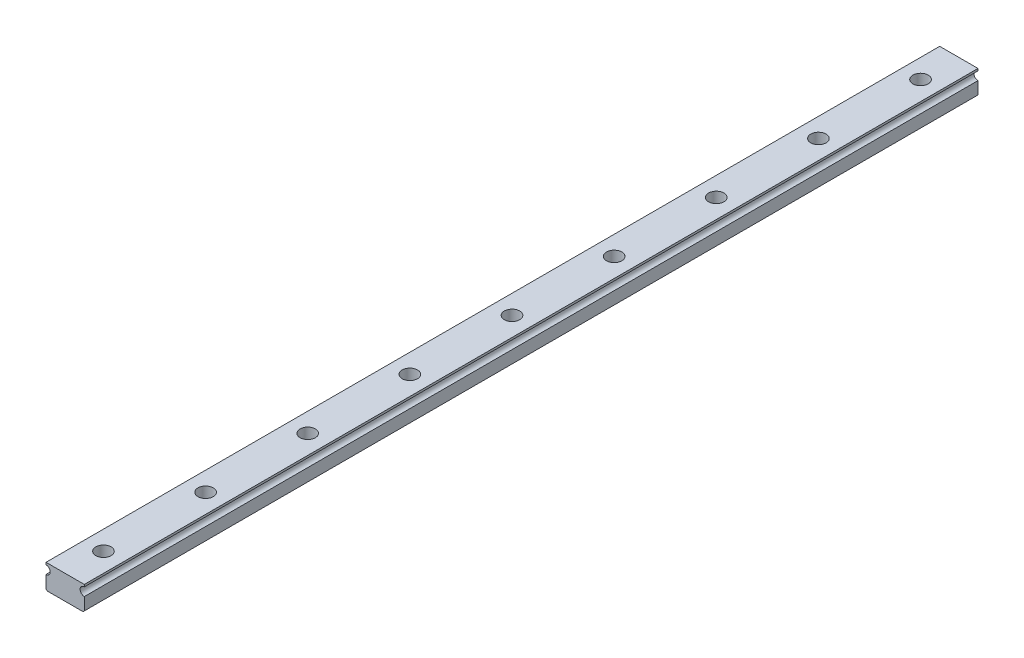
ISO-10303-21;
HEADER;
FILE_DESCRIPTION(('STEP AP214'),'2;1');
FILE_NAME('part.step','',(''),(''),'','','');
FILE_SCHEMA(('AUTOMOTIVE_DESIGN { 1 0 10303 214 1 1 1 1 }'));
ENDSEC;
DATA;
#1=APPLICATION_CONTEXT('core data for automotive mechanical design processes');
#2=APPLICATION_PROTOCOL_DEFINITION('international standard','automotive_design',2000,#1);
#3=PRODUCT_CONTEXT('',#1,'mechanical');
#4=PRODUCT('Part','Part','',(#3));
#5=PRODUCT_RELATED_PRODUCT_CATEGORY('part','',(#4));
#6=PRODUCT_DEFINITION_FORMATION('','',#4);
#7=PRODUCT_DEFINITION_CONTEXT('part definition',#1,'design');
#8=PRODUCT_DEFINITION('design','',#6,#7);
#9=PRODUCT_DEFINITION_SHAPE('','',#8);
#10=(LENGTH_UNIT() NAMED_UNIT(*) SI_UNIT(.MILLI.,.METRE.));
#11=(NAMED_UNIT(*) PLANE_ANGLE_UNIT() SI_UNIT($,.RADIAN.));
#12=(NAMED_UNIT(*) SI_UNIT($,.STERADIAN.) SOLID_ANGLE_UNIT());
#13=UNCERTAINTY_MEASURE_WITH_UNIT(LENGTH_MEASURE(1.E-05),#10,'distance_accuracy_value','');
#14=(GEOMETRIC_REPRESENTATION_CONTEXT(3) GLOBAL_UNCERTAINTY_ASSIGNED_CONTEXT((#13)) GLOBAL_UNIT_ASSIGNED_CONTEXT((#10,
#11,#12)) REPRESENTATION_CONTEXT('',''));
#15=CARTESIAN_POINT('',(0.,0.,0.));
#16=DIRECTION('',(0.,0.,1.));
#17=DIRECTION('',(1.,0.,0.));
#18=AXIS2_PLACEMENT_3D('',#15,#16,#17);
#19=CARTESIAN_POINT('',(7.5,9.5,350.));
#20=DIRECTION('',(0.,-1.,0.));
#21=DIRECTION('',(0.,0.,-1.));
#22=AXIS2_PLACEMENT_3D('',#19,#20,#21);
#23=PLANE('',#22);
#24=CARTESIAN_POINT('',(0.,9.5,95.));
#25=DIRECTION('',(0.,1.,0.));
#26=DIRECTION('',(0.,0.,1.));
#27=AXIS2_PLACEMENT_3D('',#24,#25,#26);
#28=CIRCLE('',#27,3.);
#29=CARTESIAN_POINT('',(0.,9.5,98.));
#30=VERTEX_POINT('',#29);
#31=EDGE_CURVE('E290',#30,#30,#28,.T.);
#32=ORIENTED_EDGE('',*,*,#31,.F.);
#33=EDGE_LOOP('',(#32));
#34=FACE_BOUND('',#33,.T.);
#35=CARTESIAN_POINT('',(0.,9.5,175.));
#36=DIRECTION('',(0.,1.,0.));
#37=DIRECTION('',(0.,0.,1.));
#38=AXIS2_PLACEMENT_3D('',#35,#36,#37);
#39=CIRCLE('',#38,3.);
#40=CARTESIAN_POINT('',(0.,9.5,178.));
#41=VERTEX_POINT('',#40);
#42=EDGE_CURVE('E266',#41,#41,#39,.T.);
#43=ORIENTED_EDGE('',*,*,#42,.F.);
#44=EDGE_LOOP('',(#43));
#45=FACE_BOUND('',#44,.T.);
#46=CARTESIAN_POINT('',(0.,9.5,255.));
#47=DIRECTION('',(0.,1.,0.));
#48=DIRECTION('',(0.,0.,1.));
#49=AXIS2_PLACEMENT_3D('',#46,#47,#48);
#50=CIRCLE('',#49,3.);
#51=CARTESIAN_POINT('',(0.,9.5,258.));
#52=VERTEX_POINT('',#51);
#53=EDGE_CURVE('E242',#52,#52,#50,.T.);
#54=ORIENTED_EDGE('',*,*,#53,.F.);
#55=EDGE_LOOP('',(#54));
#56=FACE_BOUND('',#55,.T.);
#57=CARTESIAN_POINT('',(0.,9.5,335.));
#58=DIRECTION('',(0.,1.,0.));
#59=DIRECTION('',(0.,0.,1.));
#60=AXIS2_PLACEMENT_3D('',#57,#58,#59);
#61=CIRCLE('',#60,3.);
#62=CARTESIAN_POINT('',(0.,9.5,338.));
#63=VERTEX_POINT('',#62);
#64=EDGE_CURVE('E218',#63,#63,#61,.T.);
#65=ORIENTED_EDGE('',*,*,#64,.F.);
#66=EDGE_LOOP('',(#65));
#67=FACE_BOUND('',#66,.T.);
#68=DIRECTION('',(-1.,0.,0.));
#69=VECTOR('',#68,1.);
#70=CARTESIAN_POINT('',(7.5,9.5,0.));
#71=LINE('',#70,#69);
#72=CARTESIAN_POINT('',(7.5,9.5,0.));
#73=VERTEX_POINT('',#72);
#74=CARTESIAN_POINT('',(-7.5,9.5,0.));
#75=VERTEX_POINT('',#74);
#76=EDGE_CURVE('E141',#73,#75,#71,.T.);
#77=ORIENTED_EDGE('',*,*,#76,.T.);
#78=DIRECTION('',(0.,0.,-1.));
#79=VECTOR('',#78,1.);
#80=CARTESIAN_POINT('',(-7.5,9.5,350.));
#81=LINE('',#80,#79);
#82=CARTESIAN_POINT('',(-7.5,9.5,350.));
#83=VERTEX_POINT('',#82);
#84=EDGE_CURVE('E11',#83,#75,#81,.T.);
#85=ORIENTED_EDGE('',*,*,#84,.F.);
#86=DIRECTION('',(-1.,0.,0.));
#87=VECTOR('',#86,1.);
#88=CARTESIAN_POINT('',(7.5,9.5,350.));
#89=LINE('',#88,#87);
#90=CARTESIAN_POINT('',(7.5,9.5,350.));
#91=VERTEX_POINT('',#90);
#92=EDGE_CURVE('E160',#91,#83,#89,.T.);
#93=ORIENTED_EDGE('',*,*,#92,.F.);
#94=DIRECTION('',(0.,0.,-1.));
#95=VECTOR('',#94,1.);
#96=CARTESIAN_POINT('',(7.5,9.5,350.));
#97=LINE('',#96,#95);
#98=EDGE_CURVE('E137',#91,#73,#97,.T.);
#99=ORIENTED_EDGE('',*,*,#98,.T.);
#100=EDGE_LOOP('',(#77,#85,#93,#99));
#101=FACE_BOUND('',#100,.T.);
#102=CARTESIAN_POINT('',(0.,9.5,15.));
#103=DIRECTION('',(0.,1.,0.));
#104=DIRECTION('',(0.,0.,1.));
#105=AXIS2_PLACEMENT_3D('',#102,#103,#104);
#106=CIRCLE('',#105,3.);
#107=CARTESIAN_POINT('',(0.,9.5,18.));
#108=VERTEX_POINT('',#107);
#109=EDGE_CURVE('E145',#108,#108,#106,.T.);
#110=ORIENTED_EDGE('',*,*,#109,.F.);
#111=EDGE_LOOP('',(#110));
#112=FACE_BOUND('',#111,.T.);
#113=CARTESIAN_POINT('',(0.,9.5,295.));
#114=DIRECTION('',(0.,1.,0.));
#115=DIRECTION('',(0.,0.,1.));
#116=AXIS2_PLACEMENT_3D('',#113,#114,#115);
#117=CIRCLE('',#116,3.);
#118=CARTESIAN_POINT('',(0.,9.5,298.));
#119=VERTEX_POINT('',#118);
#120=EDGE_CURVE('E230',#119,#119,#117,.T.);
#121=ORIENTED_EDGE('',*,*,#120,.F.);
#122=EDGE_LOOP('',(#121));
#123=FACE_BOUND('',#122,.T.);
#124=CARTESIAN_POINT('',(0.,9.5,215.));
#125=DIRECTION('',(0.,1.,0.));
#126=DIRECTION('',(0.,0.,1.));
#127=AXIS2_PLACEMENT_3D('',#124,#125,#126);
#128=CIRCLE('',#127,3.);
#129=CARTESIAN_POINT('',(0.,9.5,218.));
#130=VERTEX_POINT('',#129);
#131=EDGE_CURVE('E254',#130,#130,#128,.T.);
#132=ORIENTED_EDGE('',*,*,#131,.F.);
#133=EDGE_LOOP('',(#132));
#134=FACE_BOUND('',#133,.T.);
#135=CARTESIAN_POINT('',(0.,9.5,135.));
#136=DIRECTION('',(0.,1.,0.));
#137=DIRECTION('',(0.,0.,1.));
#138=AXIS2_PLACEMENT_3D('',#135,#136,#137);
#139=CIRCLE('',#138,3.);
#140=CARTESIAN_POINT('',(0.,9.5,138.));
#141=VERTEX_POINT('',#140);
#142=EDGE_CURVE('E278',#141,#141,#139,.T.);
#143=ORIENTED_EDGE('',*,*,#142,.F.);
#144=EDGE_LOOP('',(#143));
#145=FACE_BOUND('',#144,.T.);
#146=CARTESIAN_POINT('',(0.,9.5,55.));
#147=DIRECTION('',(0.,1.,0.));
#148=DIRECTION('',(0.,0.,1.));
#149=AXIS2_PLACEMENT_3D('',#146,#147,#148);
#150=CIRCLE('',#149,3.);
#151=CARTESIAN_POINT('',(0.,9.5,58.));
#152=VERTEX_POINT('',#151);
#153=EDGE_CURVE('E302',#152,#152,#150,.T.);
#154=ORIENTED_EDGE('',*,*,#153,.F.);
#155=EDGE_LOOP('',(#154));
#156=FACE_BOUND('',#155,.T.);
#157=ADVANCED_FACE('F33',(#34,#45,#56,#67,#101,#112,#123,#134,#145,#156),#23,.F.);
#158=CARTESIAN_POINT('',(-7.00502525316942,0.,350.));
#159=DIRECTION('',(0.,1.,0.));
#160=DIRECTION('',(0.,0.,1.));
#161=AXIS2_PLACEMENT_3D('',#158,#159,#160);
#162=PLANE('',#161);
#163=CARTESIAN_POINT('',(0.,0.,95.));
#164=DIRECTION('',(0.,1.,0.));
#165=DIRECTION('',(0.,0.,1.));
#166=AXIS2_PLACEMENT_3D('',#163,#164,#165);
#167=CIRCLE('',#166,1.75);
#168=CARTESIAN_POINT('',(0.,0.,96.75));
#169=VERTEX_POINT('',#168);
#170=EDGE_CURVE('E299',#169,#169,#167,.T.);
#171=ORIENTED_EDGE('',*,*,#170,.T.);
#172=EDGE_LOOP('',(#171));
#173=FACE_BOUND('',#172,.T.);
#174=CARTESIAN_POINT('',(0.,0.,175.));
#175=DIRECTION('',(0.,1.,0.));
#176=DIRECTION('',(0.,0.,1.));
#177=AXIS2_PLACEMENT_3D('',#174,#175,#176);
#178=CIRCLE('',#177,1.75);
#179=CARTESIAN_POINT('',(0.,0.,176.75));
#180=VERTEX_POINT('',#179);
#181=EDGE_CURVE('E275',#180,#180,#178,.T.);
#182=ORIENTED_EDGE('',*,*,#181,.T.);
#183=EDGE_LOOP('',(#182));
#184=FACE_BOUND('',#183,.T.);
#185=CARTESIAN_POINT('',(0.,0.,255.));
#186=DIRECTION('',(0.,1.,0.));
#187=DIRECTION('',(0.,0.,1.));
#188=AXIS2_PLACEMENT_3D('',#185,#186,#187);
#189=CIRCLE('',#188,1.75000000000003);
#190=CARTESIAN_POINT('',(0.,0.,256.75));
#191=VERTEX_POINT('',#190);
#192=EDGE_CURVE('E251',#191,#191,#189,.T.);
#193=ORIENTED_EDGE('',*,*,#192,.T.);
#194=EDGE_LOOP('',(#193));
#195=FACE_BOUND('',#194,.T.);
#196=CARTESIAN_POINT('',(0.,0.,335.));
#197=DIRECTION('',(0.,1.,0.));
#198=DIRECTION('',(0.,0.,1.));
#199=AXIS2_PLACEMENT_3D('',#196,#197,#198);
#200=CIRCLE('',#199,1.75000000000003);
#201=CARTESIAN_POINT('',(0.,0.,336.75));
#202=VERTEX_POINT('',#201);
#203=EDGE_CURVE('E227',#202,#202,#200,.T.);
#204=ORIENTED_EDGE('',*,*,#203,.T.);
#205=EDGE_LOOP('',(#204));
#206=FACE_BOUND('',#205,.T.);
#207=DIRECTION('',(1.,0.,0.));
#208=VECTOR('',#207,1.);
#209=CARTESIAN_POINT('',(-7.00502525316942,0.,0.));
#210=LINE('',#209,#208);
#211=CARTESIAN_POINT('',(-7.00502525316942,0.,0.));
#212=VERTEX_POINT('',#211);
#213=CARTESIAN_POINT('',(7.00502525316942,0.,0.));
#214=VERTEX_POINT('',#213);
#215=EDGE_CURVE('E153',#212,#214,#210,.T.);
#216=ORIENTED_EDGE('',*,*,#215,.T.);
#217=DIRECTION('',(0.,0.,-1.));
#218=VECTOR('',#217,1.);
#219=CARTESIAN_POINT('',(7.00502525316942,0.,350.));
#220=LINE('',#219,#218);
#221=CARTESIAN_POINT('',(7.00502525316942,0.,350.));
#222=VERTEX_POINT('',#221);
#223=EDGE_CURVE('E164',#222,#214,#220,.T.);
#224=ORIENTED_EDGE('',*,*,#223,.F.);
#225=DIRECTION('',(1.,0.,0.));
#226=VECTOR('',#225,1.);
#227=CARTESIAN_POINT('',(-7.00502525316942,0.,350.));
#228=LINE('',#227,#226);
#229=CARTESIAN_POINT('',(-7.00502525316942,0.,350.));
#230=VERTEX_POINT('',#229);
#231=EDGE_CURVE('E198',#230,#222,#228,.T.);
#232=ORIENTED_EDGE('',*,*,#231,.F.);
#233=DIRECTION('',(0.,0.,-1.));
#234=VECTOR('',#233,1.);
#235=CARTESIAN_POINT('',(-7.00502525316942,0.,350.));
#236=LINE('',#235,#234);
#237=EDGE_CURVE('E167',#230,#212,#236,.T.);
#238=ORIENTED_EDGE('',*,*,#237,.T.);
#239=EDGE_LOOP('',(#216,#224,#232,#238));
#240=FACE_BOUND('',#239,.T.);
#241=CARTESIAN_POINT('',(0.,0.,15.));
#242=DIRECTION('',(0.,1.,0.));
#243=DIRECTION('',(0.,0.,1.));
#244=AXIS2_PLACEMENT_3D('',#241,#242,#243);
#245=CIRCLE('',#244,1.75);
#246=CARTESIAN_POINT('',(0.,0.,16.75));
#247=VERTEX_POINT('',#246);
#248=EDGE_CURVE('E215',#247,#247,#245,.T.);
#249=ORIENTED_EDGE('',*,*,#248,.T.);
#250=EDGE_LOOP('',(#249));
#251=FACE_BOUND('',#250,.T.);
#252=CARTESIAN_POINT('',(0.,0.,295.));
#253=DIRECTION('',(0.,1.,0.));
#254=DIRECTION('',(0.,0.,1.));
#255=AXIS2_PLACEMENT_3D('',#252,#253,#254);
#256=CIRCLE('',#255,1.75000000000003);
#257=CARTESIAN_POINT('',(0.,0.,296.75));
#258=VERTEX_POINT('',#257);
#259=EDGE_CURVE('E239',#258,#258,#256,.T.);
#260=ORIENTED_EDGE('',*,*,#259,.T.);
#261=EDGE_LOOP('',(#260));
#262=FACE_BOUND('',#261,.T.);
#263=CARTESIAN_POINT('',(0.,0.,215.));
#264=DIRECTION('',(0.,1.,0.));
#265=DIRECTION('',(0.,0.,1.));
#266=AXIS2_PLACEMENT_3D('',#263,#264,#265);
#267=CIRCLE('',#266,1.75);
#268=CARTESIAN_POINT('',(0.,0.,216.75));
#269=VERTEX_POINT('',#268);
#270=EDGE_CURVE('E263',#269,#269,#267,.T.);
#271=ORIENTED_EDGE('',*,*,#270,.T.);
#272=EDGE_LOOP('',(#271));
#273=FACE_BOUND('',#272,.T.);
#274=CARTESIAN_POINT('',(0.,0.,135.));
#275=DIRECTION('',(0.,1.,0.));
#276=DIRECTION('',(0.,0.,1.));
#277=AXIS2_PLACEMENT_3D('',#274,#275,#276);
#278=CIRCLE('',#277,1.75);
#279=CARTESIAN_POINT('',(0.,0.,136.75));
#280=VERTEX_POINT('',#279);
#281=EDGE_CURVE('E287',#280,#280,#278,.T.);
#282=ORIENTED_EDGE('',*,*,#281,.T.);
#283=EDGE_LOOP('',(#282));
#284=FACE_BOUND('',#283,.T.);
#285=CARTESIAN_POINT('',(0.,0.,55.));
#286=DIRECTION('',(0.,1.,0.));
#287=DIRECTION('',(0.,0.,1.));
#288=AXIS2_PLACEMENT_3D('',#285,#286,#287);
#289=CIRCLE('',#288,1.75);
#290=CARTESIAN_POINT('',(0.,0.,56.75));
#291=VERTEX_POINT('',#290);
#292=EDGE_CURVE('E311',#291,#291,#289,.T.);
#293=ORIENTED_EDGE('',*,*,#292,.T.);
#294=EDGE_LOOP('',(#293));
#295=FACE_BOUND('',#294,.T.);
#296=ADVANCED_FACE('F315',(#173,#184,#195,#206,#240,#251,#262,#273,#284,#295),#162,.F.);
#297=CARTESIAN_POINT('',(-7.5,9.5,350.));
#298=DIRECTION('',(1.,0.,0.));
#299=DIRECTION('',(0.,0.,-1.));
#300=AXIS2_PLACEMENT_3D('',#297,#298,#299);
#301=PLANE('',#300);
#302=DIRECTION('',(0.,-1.,0.));
#303=VECTOR('',#302,1.);
#304=CARTESIAN_POINT('',(-7.5,9.5,0.));
#305=LINE('',#304,#303);
#306=CARTESIAN_POINT('',(-7.5,8.66,0.));
#307=VERTEX_POINT('',#306);
#308=EDGE_CURVE('E144',#75,#307,#305,.T.);
#309=ORIENTED_EDGE('',*,*,#308,.T.);
#310=DIRECTION('',(0.,0.,-1.));
#311=VECTOR('',#310,1.);
#312=CARTESIAN_POINT('',(-7.5,8.66,350.));
#313=LINE('',#312,#311);
#314=CARTESIAN_POINT('',(-7.5,8.66,350.));
#315=VERTEX_POINT('',#314);
#316=EDGE_CURVE('E41',#315,#307,#313,.T.);
#317=ORIENTED_EDGE('',*,*,#316,.F.);
#318=DIRECTION('',(0.,-1.,0.));
#319=VECTOR('',#318,1.);
#320=CARTESIAN_POINT('',(-7.5,9.5,350.));
#321=LINE('',#320,#319);
#322=EDGE_CURVE('E98',#83,#315,#321,.T.);
#323=ORIENTED_EDGE('',*,*,#322,.F.);
#324=ORIENTED_EDGE('',*,*,#84,.T.);
#325=EDGE_LOOP('',(#309,#317,#323,#324));
#326=FACE_BOUND('',#325,.T.);
#327=ADVANCED_FACE('F333',(#326),#301,.F.);
#328=CARTESIAN_POINT('',(-7.5,7.02,350.));
#329=DIRECTION('',(0.,0.,-1.));
#330=DIRECTION('',(-1.,0.,0.));
#331=AXIS2_PLACEMENT_3D('',#328,#329,#330);
#332=CYLINDRICAL_SURFACE('',#331,1.64);
#333=CARTESIAN_POINT('',(-7.5,7.02,0.));
#334=DIRECTION('',(0.,0.,-1.));
#335=DIRECTION('',(-1.,0.,0.));
#336=AXIS2_PLACEMENT_3D('',#333,#334,#335);
#337=CIRCLE('',#336,1.64);
#338=CARTESIAN_POINT('',(-7.5,5.38,0.));
#339=VERTEX_POINT('',#338);
#340=EDGE_CURVE('E147',#307,#339,#337,.T.);
#341=ORIENTED_EDGE('',*,*,#340,.T.);
#342=DIRECTION('',(0.,0.,-1.));
#343=VECTOR('',#342,1.);
#344=CARTESIAN_POINT('',(-7.5,5.38,350.));
#345=LINE('',#344,#343);
#346=CARTESIAN_POINT('',(-7.5,5.38,350.));
#347=VERTEX_POINT('',#346);
#348=EDGE_CURVE('E173',#347,#339,#345,.T.);
#349=ORIENTED_EDGE('',*,*,#348,.F.);
#350=CARTESIAN_POINT('',(-7.5,7.02,350.));
#351=DIRECTION('',(0.,0.,-1.));
#352=DIRECTION('',(-1.,0.,0.));
#353=AXIS2_PLACEMENT_3D('',#350,#351,#352);
#354=CIRCLE('',#353,1.64);
#355=EDGE_CURVE('E181',#315,#347,#354,.T.);
#356=ORIENTED_EDGE('',*,*,#355,.F.);
#357=ORIENTED_EDGE('',*,*,#316,.T.);
#358=EDGE_LOOP('',(#341,#349,#356,#357));
#359=FACE_BOUND('',#358,.T.);
#360=ADVANCED_FACE('F179',(#359),#332,.F.);
#361=CARTESIAN_POINT('',(-7.5,5.38,350.));
#362=DIRECTION('',(1.,0.,0.));
#363=DIRECTION('',(0.,0.,-1.));
#364=AXIS2_PLACEMENT_3D('',#361,#362,#363);
#365=PLANE('',#364);
#366=DIRECTION('',(0.,-1.,0.));
#367=VECTOR('',#366,1.);
#368=CARTESIAN_POINT('',(-7.5,5.38,0.));
#369=LINE('',#368,#367);
#370=CARTESIAN_POINT('',(-7.5,0.494974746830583,0.));
#371=VERTEX_POINT('',#370);
#372=EDGE_CURVE('E149',#339,#371,#369,.T.);
#373=ORIENTED_EDGE('',*,*,#372,.T.);
#374=DIRECTION('',(0.,0.,-1.));
#375=VECTOR('',#374,1.);
#376=CARTESIAN_POINT('',(-7.5,0.494974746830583,350.));
#377=LINE('',#376,#375);
#378=CARTESIAN_POINT('',(-7.5,0.494974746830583,350.));
#379=VERTEX_POINT('',#378);
#380=EDGE_CURVE('E170',#379,#371,#377,.T.);
#381=ORIENTED_EDGE('',*,*,#380,.F.);
#382=DIRECTION('',(0.,-1.,0.));
#383=VECTOR('',#382,1.);
#384=CARTESIAN_POINT('',(-7.5,5.38,350.));
#385=LINE('',#384,#383);
#386=EDGE_CURVE('E199',#347,#379,#385,.T.);
#387=ORIENTED_EDGE('',*,*,#386,.F.);
#388=ORIENTED_EDGE('',*,*,#348,.T.);
#389=EDGE_LOOP('',(#373,#381,#387,#388));
#390=FACE_BOUND('',#389,.T.);
#391=ADVANCED_FACE('F190',(#390),#365,.F.);
#392=CARTESIAN_POINT('',(-7.5,0.494974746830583,350.));
#393=DIRECTION('',(0.707106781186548,0.707106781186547,0.));
#394=DIRECTION('',(-0.707106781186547,0.707106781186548,0.));
#395=AXIS2_PLACEMENT_3D('',#392,#393,#394);
#396=PLANE('',#395);
#397=DIRECTION('',(0.707106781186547,-0.707106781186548,0.));
#398=VECTOR('',#397,1.);
#399=CARTESIAN_POINT('',(-7.5,0.494974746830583,0.));
#400=LINE('',#399,#398);
#401=EDGE_CURVE('E151',#371,#212,#400,.T.);
#402=ORIENTED_EDGE('',*,*,#401,.T.);
#403=ORIENTED_EDGE('',*,*,#237,.F.);
#404=DIRECTION('',(0.707106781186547,-0.707106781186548,0.));
#405=VECTOR('',#404,1.);
#406=CARTESIAN_POINT('',(-7.5,0.494974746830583,350.));
#407=LINE('',#406,#405);
#408=EDGE_CURVE('E196',#379,#230,#407,.T.);
#409=ORIENTED_EDGE('',*,*,#408,.F.);
#410=ORIENTED_EDGE('',*,*,#380,.T.);
#411=EDGE_LOOP('',(#402,#403,#409,#410));
#412=FACE_BOUND('',#411,.T.);
#413=ADVANCED_FACE('F194',(#412),#396,.F.);
#414=CARTESIAN_POINT('',(7.00502525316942,0.,350.));
#415=DIRECTION('',(-0.707106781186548,0.707106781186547,0.));
#416=DIRECTION('',(-0.707106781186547,-0.707106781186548,0.));
#417=AXIS2_PLACEMENT_3D('',#414,#415,#416);
#418=PLANE('',#417);
#419=DIRECTION('',(0.707106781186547,0.707106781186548,0.));
#420=VECTOR('',#419,1.);
#421=CARTESIAN_POINT('',(7.00502525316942,0.,0.));
#422=LINE('',#421,#420);
#423=CARTESIAN_POINT('',(7.5,0.494974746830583,0.));
#424=VERTEX_POINT('',#423);
#425=EDGE_CURVE('E155',#214,#424,#422,.T.);
#426=ORIENTED_EDGE('',*,*,#425,.T.);
#427=DIRECTION('',(0.,0.,-1.));
#428=VECTOR('',#427,1.);
#429=CARTESIAN_POINT('',(7.5,0.494974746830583,350.));
#430=LINE('',#429,#428);
#431=CARTESIAN_POINT('',(7.5,0.494974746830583,350.));
#432=VERTEX_POINT('',#431);
#433=EDGE_CURVE('E132',#432,#424,#430,.T.);
#434=ORIENTED_EDGE('',*,*,#433,.F.);
#435=DIRECTION('',(0.707106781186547,0.707106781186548,0.));
#436=VECTOR('',#435,1.);
#437=CARTESIAN_POINT('',(7.00502525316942,0.,350.));
#438=LINE('',#437,#436);
#439=EDGE_CURVE('E123',#222,#432,#438,.T.);
#440=ORIENTED_EDGE('',*,*,#439,.F.);
#441=ORIENTED_EDGE('',*,*,#223,.T.);
#442=EDGE_LOOP('',(#426,#434,#440,#441));
#443=FACE_BOUND('',#442,.T.);
#444=ADVANCED_FACE('F472',(#443),#418,.F.);
#445=CARTESIAN_POINT('',(7.5,0.494974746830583,350.));
#446=DIRECTION('',(-1.,0.,0.));
#447=DIRECTION('',(0.,0.,1.));
#448=AXIS2_PLACEMENT_3D('',#445,#446,#447);
#449=PLANE('',#448);
#450=DIRECTION('',(0.,1.,0.));
#451=VECTOR('',#450,1.);
#452=CARTESIAN_POINT('',(7.5,0.494974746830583,0.));
#453=LINE('',#452,#451);
#454=CARTESIAN_POINT('',(7.5,5.38,0.));
#455=VERTEX_POINT('',#454);
#456=EDGE_CURVE('E131',#424,#455,#453,.T.);
#457=ORIENTED_EDGE('',*,*,#456,.T.);
#458=DIRECTION('',(0.,0.,-1.));
#459=VECTOR('',#458,1.);
#460=CARTESIAN_POINT('',(7.5,5.38,350.));
#461=LINE('',#460,#459);
#462=CARTESIAN_POINT('',(7.5,5.38,350.));
#463=VERTEX_POINT('',#462);
#464=EDGE_CURVE('E128',#463,#455,#461,.T.);
#465=ORIENTED_EDGE('',*,*,#464,.F.);
#466=DIRECTION('',(0.,1.,0.));
#467=VECTOR('',#466,1.);
#468=CARTESIAN_POINT('',(7.5,0.494974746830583,350.));
#469=LINE('',#468,#467);
#470=EDGE_CURVE('E117',#432,#463,#469,.T.);
#471=ORIENTED_EDGE('',*,*,#470,.F.);
#472=ORIENTED_EDGE('',*,*,#433,.T.);
#473=EDGE_LOOP('',(#457,#465,#471,#472));
#474=FACE_BOUND('',#473,.T.);
#475=ADVANCED_FACE('F129',(#474),#449,.F.);
#476=CARTESIAN_POINT('',(7.5,7.02,350.));
#477=DIRECTION('',(0.,0.,-1.));
#478=DIRECTION('',(-1.,0.,0.));
#479=AXIS2_PLACEMENT_3D('',#476,#477,#478);
#480=CYLINDRICAL_SURFACE('',#479,1.64);
#481=CARTESIAN_POINT('',(7.5,7.02,0.));
#482=DIRECTION('',(0.,0.,-1.));
#483=DIRECTION('',(-1.,0.,0.));
#484=AXIS2_PLACEMENT_3D('',#481,#482,#483);
#485=CIRCLE('',#484,1.64);
#486=CARTESIAN_POINT('',(7.5,8.66,0.));
#487=VERTEX_POINT('',#486);
#488=EDGE_CURVE('E84',#455,#487,#485,.T.);
#489=ORIENTED_EDGE('',*,*,#488,.T.);
#490=DIRECTION('',(0.,0.,-1.));
#491=VECTOR('',#490,1.);
#492=CARTESIAN_POINT('',(7.5,8.66,350.));
#493=LINE('',#492,#491);
#494=CARTESIAN_POINT('',(7.5,8.66,350.));
#495=VERTEX_POINT('',#494);
#496=EDGE_CURVE('E133',#495,#487,#493,.T.);
#497=ORIENTED_EDGE('',*,*,#496,.F.);
#498=CARTESIAN_POINT('',(7.5,7.02,350.));
#499=DIRECTION('',(0.,0.,-1.));
#500=DIRECTION('',(-1.,0.,0.));
#501=AXIS2_PLACEMENT_3D('',#498,#499,#500);
#502=CIRCLE('',#501,1.64);
#503=EDGE_CURVE('E121',#463,#495,#502,.T.);
#504=ORIENTED_EDGE('',*,*,#503,.F.);
#505=ORIENTED_EDGE('',*,*,#464,.T.);
#506=EDGE_LOOP('',(#489,#497,#504,#505));
#507=FACE_BOUND('',#506,.T.);
#508=ADVANCED_FACE('F135',(#507),#480,.F.);
#509=CARTESIAN_POINT('',(7.5,8.66,350.));
#510=DIRECTION('',(-1.,0.,0.));
#511=DIRECTION('',(0.,0.,1.));
#512=AXIS2_PLACEMENT_3D('',#509,#510,#511);
#513=PLANE('',#512);
#514=DIRECTION('',(0.,1.,0.));
#515=VECTOR('',#514,1.);
#516=CARTESIAN_POINT('',(7.5,8.66,0.));
#517=LINE('',#516,#515);
#518=EDGE_CURVE('E90',#487,#73,#517,.T.);
#519=ORIENTED_EDGE('',*,*,#518,.T.);
#520=ORIENTED_EDGE('',*,*,#98,.F.);
#521=DIRECTION('',(0.,1.,0.));
#522=VECTOR('',#521,1.);
#523=CARTESIAN_POINT('',(7.5,8.66,350.));
#524=LINE('',#523,#522);
#525=EDGE_CURVE('E49',#495,#91,#524,.T.);
#526=ORIENTED_EDGE('',*,*,#525,.F.);
#527=ORIENTED_EDGE('',*,*,#496,.T.);
#528=EDGE_LOOP('',(#519,#520,#526,#527));
#529=FACE_BOUND('',#528,.T.);
#530=ADVANCED_FACE('F463',(#529),#513,.F.);
#531=CARTESIAN_POINT('',(-7.5,7.02,350.));
#532=DIRECTION('',(0.,0.,-1.));
#533=DIRECTION('',(-1.,0.,0.));
#534=AXIS2_PLACEMENT_3D('',#531,#532,#533);
#535=PLANE('',#534);
#536=ORIENTED_EDGE('',*,*,#92,.T.);
#537=ORIENTED_EDGE('',*,*,#322,.T.);
#538=ORIENTED_EDGE('',*,*,#355,.T.);
#539=ORIENTED_EDGE('',*,*,#386,.T.);
#540=ORIENTED_EDGE('',*,*,#408,.T.);
#541=ORIENTED_EDGE('',*,*,#231,.T.);
#542=ORIENTED_EDGE('',*,*,#439,.T.);
#543=ORIENTED_EDGE('',*,*,#470,.T.);
#544=ORIENTED_EDGE('',*,*,#503,.T.);
#545=ORIENTED_EDGE('',*,*,#525,.T.);
#546=EDGE_LOOP('',(#536,#537,#538,#539,#540,#541,#542,#543,#544,#545));
#547=FACE_BOUND('',#546,.T.);
#548=ADVANCED_FACE('F119',(#547),#535,.F.);
#549=CARTESIAN_POINT('',(-7.5,7.02,0.));
#550=DIRECTION('',(0.,0.,-1.));
#551=DIRECTION('',(-1.,0.,0.));
#552=AXIS2_PLACEMENT_3D('',#549,#550,#551);
#553=PLANE('',#552);
#554=ORIENTED_EDGE('',*,*,#76,.F.);
#555=ORIENTED_EDGE('',*,*,#518,.F.);
#556=ORIENTED_EDGE('',*,*,#488,.F.);
#557=ORIENTED_EDGE('',*,*,#456,.F.);
#558=ORIENTED_EDGE('',*,*,#425,.F.);
#559=ORIENTED_EDGE('',*,*,#215,.F.);
#560=ORIENTED_EDGE('',*,*,#401,.F.);
#561=ORIENTED_EDGE('',*,*,#372,.F.);
#562=ORIENTED_EDGE('',*,*,#340,.F.);
#563=ORIENTED_EDGE('',*,*,#308,.F.);
#564=EDGE_LOOP('',(#554,#555,#556,#557,#558,#559,#560,#561,#562,#563));
#565=FACE_BOUND('',#564,.T.);
#566=ADVANCED_FACE('F185',(#565),#553,.T.);
#567=CARTESIAN_POINT('',(0.,0.,15.));
#568=DIRECTION('',(0.,1.,0.));
#569=DIRECTION('',(0.,0.,1.));
#570=AXIS2_PLACEMENT_3D('',#567,#568,#569);
#571=CYLINDRICAL_SURFACE('',#570,3.);
#572=ORIENTED_EDGE('',*,*,#109,.T.);
#573=EDGE_LOOP('',(#572));
#574=FACE_BOUND('',#573,.T.);
#575=CARTESIAN_POINT('',(0.,5.,15.));
#576=DIRECTION('',(0.,1.,0.));
#577=DIRECTION('',(0.,0.,1.));
#578=AXIS2_PLACEMENT_3D('',#575,#576,#577);
#579=CIRCLE('',#578,3.);
#580=CARTESIAN_POINT('',(0.,5.,18.));
#581=VERTEX_POINT('',#580);
#582=EDGE_CURVE('E209',#581,#581,#579,.T.);
#583=ORIENTED_EDGE('',*,*,#582,.F.);
#584=EDGE_LOOP('',(#583));
#585=FACE_BOUND('',#584,.T.);
#586=ADVANCED_FACE('F456',(#574,#585),#571,.F.);
#587=CARTESIAN_POINT('',(0.,5.,12.));
#588=DIRECTION('',(0.,1.,0.));
#589=DIRECTION('',(0.,0.,1.));
#590=AXIS2_PLACEMENT_3D('',#587,#588,#589);
#591=PLANE('',#590);
#592=ORIENTED_EDGE('',*,*,#582,.T.);
#593=EDGE_LOOP('',(#592));
#594=FACE_BOUND('',#593,.T.);
#595=CARTESIAN_POINT('',(0.,5.,15.));
#596=DIRECTION('',(0.,1.,0.));
#597=DIRECTION('',(0.,0.,1.));
#598=AXIS2_PLACEMENT_3D('',#595,#596,#597);
#599=CIRCLE('',#598,1.75);
#600=CARTESIAN_POINT('',(0.,5.,16.75));
#601=VERTEX_POINT('',#600);
#602=EDGE_CURVE('E212',#601,#601,#599,.T.);
#603=ORIENTED_EDGE('',*,*,#602,.F.);
#604=EDGE_LOOP('',(#603));
#605=FACE_BOUND('',#604,.T.);
#606=ADVANCED_FACE('F452',(#594,#605),#591,.T.);
#607=CARTESIAN_POINT('',(0.,0.,15.));
#608=DIRECTION('',(0.,1.,0.));
#609=DIRECTION('',(0.,0.,1.));
#610=AXIS2_PLACEMENT_3D('',#607,#608,#609);
#611=CYLINDRICAL_SURFACE('',#610,1.75);
#612=ORIENTED_EDGE('',*,*,#602,.T.);
#613=EDGE_LOOP('',(#612));
#614=FACE_BOUND('',#613,.T.);
#615=ORIENTED_EDGE('',*,*,#248,.F.);
#616=EDGE_LOOP('',(#615));
#617=FACE_BOUND('',#616,.T.);
#618=ADVANCED_FACE('F448',(#614,#617),#611,.F.);
#619=CARTESIAN_POINT('',(0.,0.,335.));
#620=DIRECTION('',(0.,1.,0.));
#621=DIRECTION('',(0.,0.,1.));
#622=AXIS2_PLACEMENT_3D('',#619,#620,#621);
#623=CYLINDRICAL_SURFACE('',#622,3.);
#624=ORIENTED_EDGE('',*,*,#64,.T.);
#625=EDGE_LOOP('',(#624));
#626=FACE_BOUND('',#625,.T.);
#627=CARTESIAN_POINT('',(0.,5.,335.));
#628=DIRECTION('',(0.,1.,0.));
#629=DIRECTION('',(0.,0.,1.));
#630=AXIS2_PLACEMENT_3D('',#627,#628,#629);
#631=CIRCLE('',#630,3.);
#632=CARTESIAN_POINT('',(0.,5.,338.));
#633=VERTEX_POINT('',#632);
#634=EDGE_CURVE('E221',#633,#633,#631,.T.);
#635=ORIENTED_EDGE('',*,*,#634,.F.);
#636=EDGE_LOOP('',(#635));
#637=FACE_BOUND('',#636,.T.);
#638=ADVANCED_FACE('F444',(#626,#637),#623,.F.);
#639=CARTESIAN_POINT('',(0.,5.,332.));
#640=DIRECTION('',(0.,1.,0.));
#641=DIRECTION('',(0.,0.,1.));
#642=AXIS2_PLACEMENT_3D('',#639,#640,#641);
#643=PLANE('',#642);
#644=ORIENTED_EDGE('',*,*,#634,.T.);
#645=EDGE_LOOP('',(#644));
#646=FACE_BOUND('',#645,.T.);
#647=CARTESIAN_POINT('',(0.,5.,335.));
#648=DIRECTION('',(0.,1.,0.));
#649=DIRECTION('',(0.,0.,1.));
#650=AXIS2_PLACEMENT_3D('',#647,#648,#649);
#651=CIRCLE('',#650,1.75000000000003);
#652=CARTESIAN_POINT('',(0.,5.,336.75));
#653=VERTEX_POINT('',#652);
#654=EDGE_CURVE('E224',#653,#653,#651,.T.);
#655=ORIENTED_EDGE('',*,*,#654,.F.);
#656=EDGE_LOOP('',(#655));
#657=FACE_BOUND('',#656,.T.);
#658=ADVANCED_FACE('F440',(#646,#657),#643,.T.);
#659=CARTESIAN_POINT('',(0.,0.,335.));
#660=DIRECTION('',(0.,1.,0.));
#661=DIRECTION('',(0.,0.,1.));
#662=AXIS2_PLACEMENT_3D('',#659,#660,#661);
#663=CYLINDRICAL_SURFACE('',#662,1.75000000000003);
#664=ORIENTED_EDGE('',*,*,#654,.T.);
#665=EDGE_LOOP('',(#664));
#666=FACE_BOUND('',#665,.T.);
#667=ORIENTED_EDGE('',*,*,#203,.F.);
#668=EDGE_LOOP('',(#667));
#669=FACE_BOUND('',#668,.T.);
#670=ADVANCED_FACE('F436',(#666,#669),#663,.F.);
#671=CARTESIAN_POINT('',(0.,0.,295.));
#672=DIRECTION('',(0.,1.,0.));
#673=DIRECTION('',(0.,0.,1.));
#674=AXIS2_PLACEMENT_3D('',#671,#672,#673);
#675=CYLINDRICAL_SURFACE('',#674,3.);
#676=ORIENTED_EDGE('',*,*,#120,.T.);
#677=EDGE_LOOP('',(#676));
#678=FACE_BOUND('',#677,.T.);
#679=CARTESIAN_POINT('',(0.,5.,295.));
#680=DIRECTION('',(0.,1.,0.));
#681=DIRECTION('',(0.,0.,1.));
#682=AXIS2_PLACEMENT_3D('',#679,#680,#681);
#683=CIRCLE('',#682,3.);
#684=CARTESIAN_POINT('',(0.,5.,298.));
#685=VERTEX_POINT('',#684);
#686=EDGE_CURVE('E233',#685,#685,#683,.T.);
#687=ORIENTED_EDGE('',*,*,#686,.F.);
#688=EDGE_LOOP('',(#687));
#689=FACE_BOUND('',#688,.T.);
#690=ADVANCED_FACE('F432',(#678,#689),#675,.F.);
#691=CARTESIAN_POINT('',(0.,5.,292.));
#692=DIRECTION('',(0.,1.,0.));
#693=DIRECTION('',(0.,0.,1.));
#694=AXIS2_PLACEMENT_3D('',#691,#692,#693);
#695=PLANE('',#694);
#696=ORIENTED_EDGE('',*,*,#686,.T.);
#697=EDGE_LOOP('',(#696));
#698=FACE_BOUND('',#697,.T.);
#699=CARTESIAN_POINT('',(0.,5.,295.));
#700=DIRECTION('',(0.,1.,0.));
#701=DIRECTION('',(0.,0.,1.));
#702=AXIS2_PLACEMENT_3D('',#699,#700,#701);
#703=CIRCLE('',#702,1.75000000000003);
#704=CARTESIAN_POINT('',(0.,5.,296.75));
#705=VERTEX_POINT('',#704);
#706=EDGE_CURVE('E236',#705,#705,#703,.T.);
#707=ORIENTED_EDGE('',*,*,#706,.F.);
#708=EDGE_LOOP('',(#707));
#709=FACE_BOUND('',#708,.T.);
#710=ADVANCED_FACE('F428',(#698,#709),#695,.T.);
#711=CARTESIAN_POINT('',(0.,0.,295.));
#712=DIRECTION('',(0.,1.,0.));
#713=DIRECTION('',(0.,0.,1.));
#714=AXIS2_PLACEMENT_3D('',#711,#712,#713);
#715=CYLINDRICAL_SURFACE('',#714,1.75000000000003);
#716=ORIENTED_EDGE('',*,*,#706,.T.);
#717=EDGE_LOOP('',(#716));
#718=FACE_BOUND('',#717,.T.);
#719=ORIENTED_EDGE('',*,*,#259,.F.);
#720=EDGE_LOOP('',(#719));
#721=FACE_BOUND('',#720,.T.);
#722=ADVANCED_FACE('F424',(#718,#721),#715,.F.);
#723=CARTESIAN_POINT('',(0.,0.,255.));
#724=DIRECTION('',(0.,1.,0.));
#725=DIRECTION('',(0.,0.,1.));
#726=AXIS2_PLACEMENT_3D('',#723,#724,#725);
#727=CYLINDRICAL_SURFACE('',#726,3.);
#728=ORIENTED_EDGE('',*,*,#53,.T.);
#729=EDGE_LOOP('',(#728));
#730=FACE_BOUND('',#729,.T.);
#731=CARTESIAN_POINT('',(0.,5.,255.));
#732=DIRECTION('',(0.,1.,0.));
#733=DIRECTION('',(0.,0.,1.));
#734=AXIS2_PLACEMENT_3D('',#731,#732,#733);
#735=CIRCLE('',#734,3.);
#736=CARTESIAN_POINT('',(0.,5.,258.));
#737=VERTEX_POINT('',#736);
#738=EDGE_CURVE('E245',#737,#737,#735,.T.);
#739=ORIENTED_EDGE('',*,*,#738,.F.);
#740=EDGE_LOOP('',(#739));
#741=FACE_BOUND('',#740,.T.);
#742=ADVANCED_FACE('F420',(#730,#741),#727,.F.);
#743=CARTESIAN_POINT('',(0.,5.,252.));
#744=DIRECTION('',(0.,1.,0.));
#745=DIRECTION('',(0.,0.,1.));
#746=AXIS2_PLACEMENT_3D('',#743,#744,#745);
#747=PLANE('',#746);
#748=ORIENTED_EDGE('',*,*,#738,.T.);
#749=EDGE_LOOP('',(#748));
#750=FACE_BOUND('',#749,.T.);
#751=CARTESIAN_POINT('',(0.,5.,255.));
#752=DIRECTION('',(0.,1.,0.));
#753=DIRECTION('',(0.,0.,1.));
#754=AXIS2_PLACEMENT_3D('',#751,#752,#753);
#755=CIRCLE('',#754,1.75000000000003);
#756=CARTESIAN_POINT('',(0.,5.,256.75));
#757=VERTEX_POINT('',#756);
#758=EDGE_CURVE('E248',#757,#757,#755,.T.);
#759=ORIENTED_EDGE('',*,*,#758,.F.);
#760=EDGE_LOOP('',(#759));
#761=FACE_BOUND('',#760,.T.);
#762=ADVANCED_FACE('F416',(#750,#761),#747,.T.);
#763=CARTESIAN_POINT('',(0.,0.,255.));
#764=DIRECTION('',(0.,1.,0.));
#765=DIRECTION('',(0.,0.,1.));
#766=AXIS2_PLACEMENT_3D('',#763,#764,#765);
#767=CYLINDRICAL_SURFACE('',#766,1.75000000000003);
#768=ORIENTED_EDGE('',*,*,#758,.T.);
#769=EDGE_LOOP('',(#768));
#770=FACE_BOUND('',#769,.T.);
#771=ORIENTED_EDGE('',*,*,#192,.F.);
#772=EDGE_LOOP('',(#771));
#773=FACE_BOUND('',#772,.T.);
#774=ADVANCED_FACE('F412',(#770,#773),#767,.F.);
#775=CARTESIAN_POINT('',(0.,0.,215.));
#776=DIRECTION('',(0.,1.,0.));
#777=DIRECTION('',(0.,0.,1.));
#778=AXIS2_PLACEMENT_3D('',#775,#776,#777);
#779=CYLINDRICAL_SURFACE('',#778,3.);
#780=ORIENTED_EDGE('',*,*,#131,.T.);
#781=EDGE_LOOP('',(#780));
#782=FACE_BOUND('',#781,.T.);
#783=CARTESIAN_POINT('',(0.,5.,215.));
#784=DIRECTION('',(0.,1.,0.));
#785=DIRECTION('',(0.,0.,1.));
#786=AXIS2_PLACEMENT_3D('',#783,#784,#785);
#787=CIRCLE('',#786,3.);
#788=CARTESIAN_POINT('',(0.,5.,218.));
#789=VERTEX_POINT('',#788);
#790=EDGE_CURVE('E257',#789,#789,#787,.T.);
#791=ORIENTED_EDGE('',*,*,#790,.F.);
#792=EDGE_LOOP('',(#791));
#793=FACE_BOUND('',#792,.T.);
#794=ADVANCED_FACE('F408',(#782,#793),#779,.F.);
#795=CARTESIAN_POINT('',(0.,5.,212.));
#796=DIRECTION('',(0.,1.,0.));
#797=DIRECTION('',(0.,0.,1.));
#798=AXIS2_PLACEMENT_3D('',#795,#796,#797);
#799=PLANE('',#798);
#800=ORIENTED_EDGE('',*,*,#790,.T.);
#801=EDGE_LOOP('',(#800));
#802=FACE_BOUND('',#801,.T.);
#803=CARTESIAN_POINT('',(0.,5.,215.));
#804=DIRECTION('',(0.,1.,0.));
#805=DIRECTION('',(0.,0.,1.));
#806=AXIS2_PLACEMENT_3D('',#803,#804,#805);
#807=CIRCLE('',#806,1.75);
#808=CARTESIAN_POINT('',(0.,5.,216.75));
#809=VERTEX_POINT('',#808);
#810=EDGE_CURVE('E260',#809,#809,#807,.T.);
#811=ORIENTED_EDGE('',*,*,#810,.F.);
#812=EDGE_LOOP('',(#811));
#813=FACE_BOUND('',#812,.T.);
#814=ADVANCED_FACE('F404',(#802,#813),#799,.T.);
#815=CARTESIAN_POINT('',(0.,0.,215.));
#816=DIRECTION('',(0.,1.,0.));
#817=DIRECTION('',(0.,0.,1.));
#818=AXIS2_PLACEMENT_3D('',#815,#816,#817);
#819=CYLINDRICAL_SURFACE('',#818,1.75);
#820=ORIENTED_EDGE('',*,*,#810,.T.);
#821=EDGE_LOOP('',(#820));
#822=FACE_BOUND('',#821,.T.);
#823=ORIENTED_EDGE('',*,*,#270,.F.);
#824=EDGE_LOOP('',(#823));
#825=FACE_BOUND('',#824,.T.);
#826=ADVANCED_FACE('F400',(#822,#825),#819,.F.);
#827=CARTESIAN_POINT('',(0.,0.,175.));
#828=DIRECTION('',(0.,1.,0.));
#829=DIRECTION('',(0.,0.,1.));
#830=AXIS2_PLACEMENT_3D('',#827,#828,#829);
#831=CYLINDRICAL_SURFACE('',#830,3.);
#832=ORIENTED_EDGE('',*,*,#42,.T.);
#833=EDGE_LOOP('',(#832));
#834=FACE_BOUND('',#833,.T.);
#835=CARTESIAN_POINT('',(0.,5.,175.));
#836=DIRECTION('',(0.,1.,0.));
#837=DIRECTION('',(0.,0.,1.));
#838=AXIS2_PLACEMENT_3D('',#835,#836,#837);
#839=CIRCLE('',#838,3.);
#840=CARTESIAN_POINT('',(0.,5.,178.));
#841=VERTEX_POINT('',#840);
#842=EDGE_CURVE('E269',#841,#841,#839,.T.);
#843=ORIENTED_EDGE('',*,*,#842,.F.);
#844=EDGE_LOOP('',(#843));
#845=FACE_BOUND('',#844,.T.);
#846=ADVANCED_FACE('F396',(#834,#845),#831,.F.);
#847=CARTESIAN_POINT('',(0.,5.,172.));
#848=DIRECTION('',(0.,1.,0.));
#849=DIRECTION('',(0.,0.,1.));
#850=AXIS2_PLACEMENT_3D('',#847,#848,#849);
#851=PLANE('',#850);
#852=ORIENTED_EDGE('',*,*,#842,.T.);
#853=EDGE_LOOP('',(#852));
#854=FACE_BOUND('',#853,.T.);
#855=CARTESIAN_POINT('',(0.,5.,175.));
#856=DIRECTION('',(0.,1.,0.));
#857=DIRECTION('',(0.,0.,1.));
#858=AXIS2_PLACEMENT_3D('',#855,#856,#857);
#859=CIRCLE('',#858,1.75);
#860=CARTESIAN_POINT('',(0.,5.,176.75));
#861=VERTEX_POINT('',#860);
#862=EDGE_CURVE('E272',#861,#861,#859,.T.);
#863=ORIENTED_EDGE('',*,*,#862,.F.);
#864=EDGE_LOOP('',(#863));
#865=FACE_BOUND('',#864,.T.);
#866=ADVANCED_FACE('F392',(#854,#865),#851,.T.);
#867=CARTESIAN_POINT('',(0.,0.,175.));
#868=DIRECTION('',(0.,1.,0.));
#869=DIRECTION('',(0.,0.,1.));
#870=AXIS2_PLACEMENT_3D('',#867,#868,#869);
#871=CYLINDRICAL_SURFACE('',#870,1.75);
#872=ORIENTED_EDGE('',*,*,#862,.T.);
#873=EDGE_LOOP('',(#872));
#874=FACE_BOUND('',#873,.T.);
#875=ORIENTED_EDGE('',*,*,#181,.F.);
#876=EDGE_LOOP('',(#875));
#877=FACE_BOUND('',#876,.T.);
#878=ADVANCED_FACE('F388',(#874,#877),#871,.F.);
#879=CARTESIAN_POINT('',(0.,0.,135.));
#880=DIRECTION('',(0.,1.,0.));
#881=DIRECTION('',(0.,0.,1.));
#882=AXIS2_PLACEMENT_3D('',#879,#880,#881);
#883=CYLINDRICAL_SURFACE('',#882,3.);
#884=ORIENTED_EDGE('',*,*,#142,.T.);
#885=EDGE_LOOP('',(#884));
#886=FACE_BOUND('',#885,.T.);
#887=CARTESIAN_POINT('',(0.,5.,135.));
#888=DIRECTION('',(0.,1.,0.));
#889=DIRECTION('',(0.,0.,1.));
#890=AXIS2_PLACEMENT_3D('',#887,#888,#889);
#891=CIRCLE('',#890,3.);
#892=CARTESIAN_POINT('',(0.,5.,138.));
#893=VERTEX_POINT('',#892);
#894=EDGE_CURVE('E281',#893,#893,#891,.T.);
#895=ORIENTED_EDGE('',*,*,#894,.F.);
#896=EDGE_LOOP('',(#895));
#897=FACE_BOUND('',#896,.T.);
#898=ADVANCED_FACE('F384',(#886,#897),#883,.F.);
#899=CARTESIAN_POINT('',(0.,5.,132.));
#900=DIRECTION('',(0.,1.,0.));
#901=DIRECTION('',(0.,0.,1.));
#902=AXIS2_PLACEMENT_3D('',#899,#900,#901);
#903=PLANE('',#902);
#904=ORIENTED_EDGE('',*,*,#894,.T.);
#905=EDGE_LOOP('',(#904));
#906=FACE_BOUND('',#905,.T.);
#907=CARTESIAN_POINT('',(0.,5.,135.));
#908=DIRECTION('',(0.,1.,0.));
#909=DIRECTION('',(0.,0.,1.));
#910=AXIS2_PLACEMENT_3D('',#907,#908,#909);
#911=CIRCLE('',#910,1.75);
#912=CARTESIAN_POINT('',(0.,5.,136.75));
#913=VERTEX_POINT('',#912);
#914=EDGE_CURVE('E284',#913,#913,#911,.T.);
#915=ORIENTED_EDGE('',*,*,#914,.F.);
#916=EDGE_LOOP('',(#915));
#917=FACE_BOUND('',#916,.T.);
#918=ADVANCED_FACE('F380',(#906,#917),#903,.T.);
#919=CARTESIAN_POINT('',(0.,0.,135.));
#920=DIRECTION('',(0.,1.,0.));
#921=DIRECTION('',(0.,0.,1.));
#922=AXIS2_PLACEMENT_3D('',#919,#920,#921);
#923=CYLINDRICAL_SURFACE('',#922,1.75);
#924=ORIENTED_EDGE('',*,*,#914,.T.);
#925=EDGE_LOOP('',(#924));
#926=FACE_BOUND('',#925,.T.);
#927=ORIENTED_EDGE('',*,*,#281,.F.);
#928=EDGE_LOOP('',(#927));
#929=FACE_BOUND('',#928,.T.);
#930=ADVANCED_FACE('F376',(#926,#929),#923,.F.);
#931=CARTESIAN_POINT('',(0.,0.,95.));
#932=DIRECTION('',(0.,1.,0.));
#933=DIRECTION('',(0.,0.,1.));
#934=AXIS2_PLACEMENT_3D('',#931,#932,#933);
#935=CYLINDRICAL_SURFACE('',#934,3.);
#936=ORIENTED_EDGE('',*,*,#31,.T.);
#937=EDGE_LOOP('',(#936));
#938=FACE_BOUND('',#937,.T.);
#939=CARTESIAN_POINT('',(0.,5.,95.));
#940=DIRECTION('',(0.,1.,0.));
#941=DIRECTION('',(0.,0.,1.));
#942=AXIS2_PLACEMENT_3D('',#939,#940,#941);
#943=CIRCLE('',#942,3.);
#944=CARTESIAN_POINT('',(0.,5.,98.));
#945=VERTEX_POINT('',#944);
#946=EDGE_CURVE('E293',#945,#945,#943,.T.);
#947=ORIENTED_EDGE('',*,*,#946,.F.);
#948=EDGE_LOOP('',(#947));
#949=FACE_BOUND('',#948,.T.);
#950=ADVANCED_FACE('F372',(#938,#949),#935,.F.);
#951=CARTESIAN_POINT('',(0.,5.,92.));
#952=DIRECTION('',(0.,1.,0.));
#953=DIRECTION('',(0.,0.,1.));
#954=AXIS2_PLACEMENT_3D('',#951,#952,#953);
#955=PLANE('',#954);
#956=ORIENTED_EDGE('',*,*,#946,.T.);
#957=EDGE_LOOP('',(#956));
#958=FACE_BOUND('',#957,.T.);
#959=CARTESIAN_POINT('',(0.,5.,95.));
#960=DIRECTION('',(0.,1.,0.));
#961=DIRECTION('',(0.,0.,1.));
#962=AXIS2_PLACEMENT_3D('',#959,#960,#961);
#963=CIRCLE('',#962,1.75);
#964=CARTESIAN_POINT('',(0.,5.,96.75));
#965=VERTEX_POINT('',#964);
#966=EDGE_CURVE('E296',#965,#965,#963,.T.);
#967=ORIENTED_EDGE('',*,*,#966,.F.);
#968=EDGE_LOOP('',(#967));
#969=FACE_BOUND('',#968,.T.);
#970=ADVANCED_FACE('F366',(#958,#969),#955,.T.);
#971=CARTESIAN_POINT('',(0.,0.,95.));
#972=DIRECTION('',(0.,1.,0.));
#973=DIRECTION('',(0.,0.,1.));
#974=AXIS2_PLACEMENT_3D('',#971,#972,#973);
#975=CYLINDRICAL_SURFACE('',#974,1.75);
#976=ORIENTED_EDGE('',*,*,#966,.T.);
#977=EDGE_LOOP('',(#976));
#978=FACE_BOUND('',#977,.T.);
#979=ORIENTED_EDGE('',*,*,#170,.F.);
#980=EDGE_LOOP('',(#979));
#981=FACE_BOUND('',#980,.T.);
#982=ADVANCED_FACE('F358',(#978,#981),#975,.F.);
#983=CARTESIAN_POINT('',(0.,0.,55.));
#984=DIRECTION('',(0.,1.,0.));
#985=DIRECTION('',(0.,0.,1.));
#986=AXIS2_PLACEMENT_3D('',#983,#984,#985);
#987=CYLINDRICAL_SURFACE('',#986,3.);
#988=ORIENTED_EDGE('',*,*,#153,.T.);
#989=EDGE_LOOP('',(#988));
#990=FACE_BOUND('',#989,.T.);
#991=CARTESIAN_POINT('',(0.,5.,55.));
#992=DIRECTION('',(0.,1.,0.));
#993=DIRECTION('',(0.,0.,1.));
#994=AXIS2_PLACEMENT_3D('',#991,#992,#993);
#995=CIRCLE('',#994,3.);
#996=CARTESIAN_POINT('',(0.,5.,58.));
#997=VERTEX_POINT('',#996);
#998=EDGE_CURVE('E305',#997,#997,#995,.T.);
#999=ORIENTED_EDGE('',*,*,#998,.F.);
#1000=EDGE_LOOP('',(#999));
#1001=FACE_BOUND('',#1000,.T.);
#1002=ADVANCED_FACE('F325',(#990,#1001),#987,.F.);
#1003=CARTESIAN_POINT('',(0.,5.,52.));
#1004=DIRECTION('',(0.,1.,0.));
#1005=DIRECTION('',(0.,0.,1.));
#1006=AXIS2_PLACEMENT_3D('',#1003,#1004,#1005);
#1007=PLANE('',#1006);
#1008=ORIENTED_EDGE('',*,*,#998,.T.);
#1009=EDGE_LOOP('',(#1008));
#1010=FACE_BOUND('',#1009,.T.);
#1011=CARTESIAN_POINT('',(0.,5.,55.));
#1012=DIRECTION('',(0.,1.,0.));
#1013=DIRECTION('',(0.,0.,1.));
#1014=AXIS2_PLACEMENT_3D('',#1011,#1012,#1013);
#1015=CIRCLE('',#1014,1.75);
#1016=CARTESIAN_POINT('',(0.,5.,56.75));
#1017=VERTEX_POINT('',#1016);
#1018=EDGE_CURVE('E308',#1017,#1017,#1015,.T.);
#1019=ORIENTED_EDGE('',*,*,#1018,.F.);
#1020=EDGE_LOOP('',(#1019));
#1021=FACE_BOUND('',#1020,.T.);
#1022=ADVANCED_FACE('F319',(#1010,#1021),#1007,.T.);
#1023=CARTESIAN_POINT('',(0.,0.,55.));
#1024=DIRECTION('',(0.,1.,0.));
#1025=DIRECTION('',(0.,0.,1.));
#1026=AXIS2_PLACEMENT_3D('',#1023,#1024,#1025);
#1027=CYLINDRICAL_SURFACE('',#1026,1.75);
#1028=ORIENTED_EDGE('',*,*,#1018,.T.);
#1029=EDGE_LOOP('',(#1028));
#1030=FACE_BOUND('',#1029,.T.);
#1031=ORIENTED_EDGE('',*,*,#292,.F.);
#1032=EDGE_LOOP('',(#1031));
#1033=FACE_BOUND('',#1032,.T.);
#1034=ADVANCED_FACE('F317',(#1030,#1033),#1027,.F.);
#1035=CLOSED_SHELL('',(#157,#296,#327,#360,#391,#413,#444,#475,#508,#530,#548,#566,#586,#606,
#618,#638,#658,#670,#690,#710,#722,#742,#762,#774,#794,#814,#826,#846,#866,#878,#898,#918,#930,
#950,#970,#982,#1002,#1022,#1034));
#1036=MANIFOLD_SOLID_BREP('B2',#1035);
#1037=ADVANCED_BREP_SHAPE_REPRESENTATION('',(#18,#1036),#14);
#1038=SHAPE_DEFINITION_REPRESENTATION(#9,#1037);
ENDSEC;
END-ISO-10303-21;
